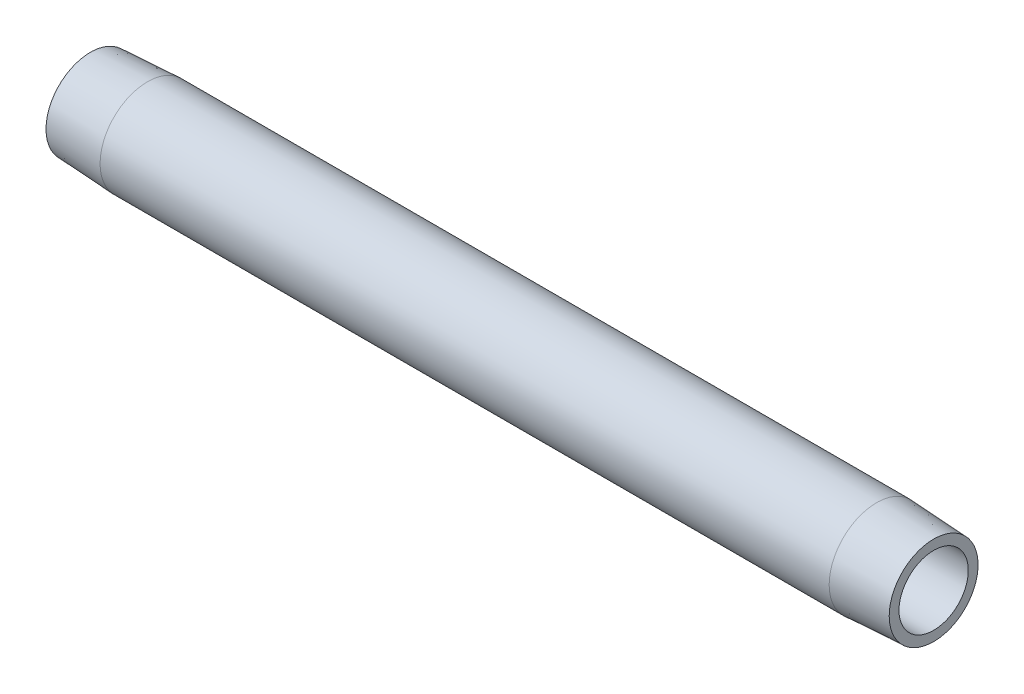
ISO-10303-21;
HEADER;
FILE_DESCRIPTION(('STEP AP214'),'2;1');
FILE_NAME('part.step','',(''),(''),'','','');
FILE_SCHEMA(('AUTOMOTIVE_DESIGN { 1 0 10303 214 1 1 1 1 }'));
ENDSEC;
DATA;
#1=APPLICATION_CONTEXT('core data for automotive mechanical design processes');
#2=APPLICATION_PROTOCOL_DEFINITION('international standard','automotive_design',2000,#1);
#3=PRODUCT_CONTEXT('',#1,'mechanical');
#4=PRODUCT('Part','Part','',(#3));
#5=PRODUCT_RELATED_PRODUCT_CATEGORY('part','',(#4));
#6=PRODUCT_DEFINITION_FORMATION('','',#4);
#7=PRODUCT_DEFINITION_CONTEXT('part definition',#1,'design');
#8=PRODUCT_DEFINITION('design','',#6,#7);
#9=PRODUCT_DEFINITION_SHAPE('','',#8);
#10=(LENGTH_UNIT() NAMED_UNIT(*) SI_UNIT(.MILLI.,.METRE.));
#11=(NAMED_UNIT(*) PLANE_ANGLE_UNIT() SI_UNIT($,.RADIAN.));
#12=(NAMED_UNIT(*) SI_UNIT($,.STERADIAN.) SOLID_ANGLE_UNIT());
#13=UNCERTAINTY_MEASURE_WITH_UNIT(LENGTH_MEASURE(1.E-05),#10,'distance_accuracy_value','');
#14=(GEOMETRIC_REPRESENTATION_CONTEXT(3) GLOBAL_UNCERTAINTY_ASSIGNED_CONTEXT((#13)) GLOBAL_UNIT_ASSIGNED_CONTEXT((#10,
#11,#12)) REPRESENTATION_CONTEXT('',''));
#15=CARTESIAN_POINT('',(0.,0.,0.));
#16=DIRECTION('',(0.,0.,1.));
#17=DIRECTION('',(1.,0.,0.));
#18=AXIS2_PLACEMENT_3D('',#15,#16,#17);
#19=CARTESIAN_POINT('',(152.4,6.26110000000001,0.));
#20=DIRECTION('',(-1.,0.,0.));
#21=DIRECTION('',(0.,0.,1.));
#22=AXIS2_PLACEMENT_3D('',#19,#20,#21);
#23=PLANE('',#22);
#24=CARTESIAN_POINT('',(152.4,0.,0.));
#25=DIRECTION('',(-1.,0.,0.));
#26=DIRECTION('',(0.,0.,1.));
#27=AXIS2_PLACEMENT_3D('',#24,#25,#26);
#28=CIRCLE('',#27,8.03205001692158);
#29=CARTESIAN_POINT('',(152.4,0.,8.03205001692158));
#30=VERTEX_POINT('',#29);
#31=EDGE_CURVE('E10',#30,#30,#28,.T.);
#32=ORIENTED_EDGE('',*,*,#31,.F.);
#33=EDGE_LOOP('',(#32));
#34=FACE_BOUND('',#33,.T.);
#35=CARTESIAN_POINT('',(152.4,0.,0.));
#36=DIRECTION('',(-1.,0.,0.));
#37=DIRECTION('',(0.,0.,1.));
#38=AXIS2_PLACEMENT_3D('',#35,#36,#37);
#39=CIRCLE('',#38,6.26110000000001);
#40=CARTESIAN_POINT('',(152.4,0.,6.26110000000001));
#41=VERTEX_POINT('',#40);
#42=EDGE_CURVE('E52',#41,#41,#39,.T.);
#43=ORIENTED_EDGE('',*,*,#42,.T.);
#44=EDGE_LOOP('',(#43));
#45=FACE_BOUND('',#44,.T.);
#46=ADVANCED_FACE('F30',(#34,#45),#23,.F.);
#47=CARTESIAN_POINT('',(152.4,0.,0.));
#48=DIRECTION('',(-1.,0.,0.));
#49=DIRECTION('',(0.,0.,1.));
#50=AXIS2_PLACEMENT_3D('',#47,#48,#49);
#51=CONICAL_SURFACE('',#50,8.03205001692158,0.0523598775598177);
#52=CARTESIAN_POINT('',(142.0876,0.,0.));
#53=DIRECTION('',(-1.,0.,0.));
#54=DIRECTION('',(0.,0.,1.));
#55=AXIS2_PLACEMENT_3D('',#52,#53,#54);
#56=CIRCLE('',#55,8.57249999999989);
#57=CARTESIAN_POINT('',(142.0876,0.,8.57249999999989));
#58=VERTEX_POINT('',#57);
#59=EDGE_CURVE('E36',#58,#58,#56,.T.);
#60=ORIENTED_EDGE('',*,*,#59,.F.);
#61=EDGE_LOOP('',(#60));
#62=FACE_BOUND('',#61,.T.);
#63=ORIENTED_EDGE('',*,*,#31,.T.);
#64=EDGE_LOOP('',(#63));
#65=FACE_BOUND('',#64,.T.);
#66=ADVANCED_FACE('F77',(#62,#65),#51,.T.);
#67=CARTESIAN_POINT('',(0.,0.,0.));
#68=DIRECTION('',(-1.,0.,0.));
#69=DIRECTION('',(0.,0.,1.));
#70=AXIS2_PLACEMENT_3D('',#67,#68,#69);
#71=CYLINDRICAL_SURFACE('',#70,8.57249999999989);
#72=CARTESIAN_POINT('',(10.3124,0.,0.));
#73=DIRECTION('',(-1.,0.,0.));
#74=DIRECTION('',(0.,0.,1.));
#75=AXIS2_PLACEMENT_3D('',#72,#73,#74);
#76=CIRCLE('',#75,8.57249999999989);
#77=CARTESIAN_POINT('',(10.3124,0.,8.57249999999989));
#78=VERTEX_POINT('',#77);
#79=EDGE_CURVE('E40',#78,#78,#76,.T.);
#80=ORIENTED_EDGE('',*,*,#79,.F.);
#81=EDGE_LOOP('',(#80));
#82=FACE_BOUND('',#81,.T.);
#83=ORIENTED_EDGE('',*,*,#59,.T.);
#84=EDGE_LOOP('',(#83));
#85=FACE_BOUND('',#84,.T.);
#86=ADVANCED_FACE('F72',(#82,#85),#71,.T.);
#87=CARTESIAN_POINT('',(10.3124,0.,0.));
#88=DIRECTION('',(1.,0.,0.));
#89=DIRECTION('',(0.,0.,-1.));
#90=AXIS2_PLACEMENT_3D('',#87,#88,#89);
#91=CONICAL_SURFACE('',#90,8.57249999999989,0.0523598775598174);
#92=CARTESIAN_POINT('',(0.,0.,0.));
#93=DIRECTION('',(-1.,0.,0.));
#94=DIRECTION('',(0.,0.,1.));
#95=AXIS2_PLACEMENT_3D('',#92,#93,#94);
#96=CIRCLE('',#95,8.03205001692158);
#97=CARTESIAN_POINT('',(0.,0.,8.03205001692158));
#98=VERTEX_POINT('',#97);
#99=EDGE_CURVE('E44',#98,#98,#96,.T.);
#100=ORIENTED_EDGE('',*,*,#99,.F.);
#101=EDGE_LOOP('',(#100));
#102=FACE_BOUND('',#101,.T.);
#103=ORIENTED_EDGE('',*,*,#79,.T.);
#104=EDGE_LOOP('',(#103));
#105=FACE_BOUND('',#104,.T.);
#106=ADVANCED_FACE('F66',(#102,#105),#91,.T.);
#107=CARTESIAN_POINT('',(0.,6.26110000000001,0.));
#108=DIRECTION('',(1.,0.,0.));
#109=DIRECTION('',(0.,0.,-1.));
#110=AXIS2_PLACEMENT_3D('',#107,#108,#109);
#111=PLANE('',#110);
#112=CARTESIAN_POINT('',(0.,0.,0.));
#113=DIRECTION('',(-1.,0.,0.));
#114=DIRECTION('',(0.,0.,1.));
#115=AXIS2_PLACEMENT_3D('',#112,#113,#114);
#116=CIRCLE('',#115,6.26110000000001);
#117=CARTESIAN_POINT('',(0.,0.,6.26110000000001));
#118=VERTEX_POINT('',#117);
#119=EDGE_CURVE('E49',#118,#118,#116,.T.);
#120=ORIENTED_EDGE('',*,*,#119,.F.);
#121=EDGE_LOOP('',(#120));
#122=FACE_BOUND('',#121,.T.);
#123=ORIENTED_EDGE('',*,*,#99,.T.);
#124=EDGE_LOOP('',(#123));
#125=FACE_BOUND('',#124,.T.);
#126=ADVANCED_FACE('F60',(#122,#125),#111,.F.);
#127=CARTESIAN_POINT('',(0.,0.,0.));
#128=DIRECTION('',(-1.,0.,0.));
#129=DIRECTION('',(0.,0.,1.));
#130=AXIS2_PLACEMENT_3D('',#127,#128,#129);
#131=CYLINDRICAL_SURFACE('',#130,6.26110000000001);
#132=ORIENTED_EDGE('',*,*,#42,.F.);
#133=EDGE_LOOP('',(#132));
#134=FACE_BOUND('',#133,.T.);
#135=ORIENTED_EDGE('',*,*,#119,.T.);
#136=EDGE_LOOP('',(#135));
#137=FACE_BOUND('',#136,.T.);
#138=ADVANCED_FACE('F57',(#134,#137),#131,.F.);
#139=CLOSED_SHELL('',(#46,#66,#86,#106,#126,#138));
#140=MANIFOLD_SOLID_BREP('B2',#139);
#141=ADVANCED_BREP_SHAPE_REPRESENTATION('',(#18,#140),#14);
#142=SHAPE_DEFINITION_REPRESENTATION(#9,#141);
ENDSEC;
END-ISO-10303-21;
